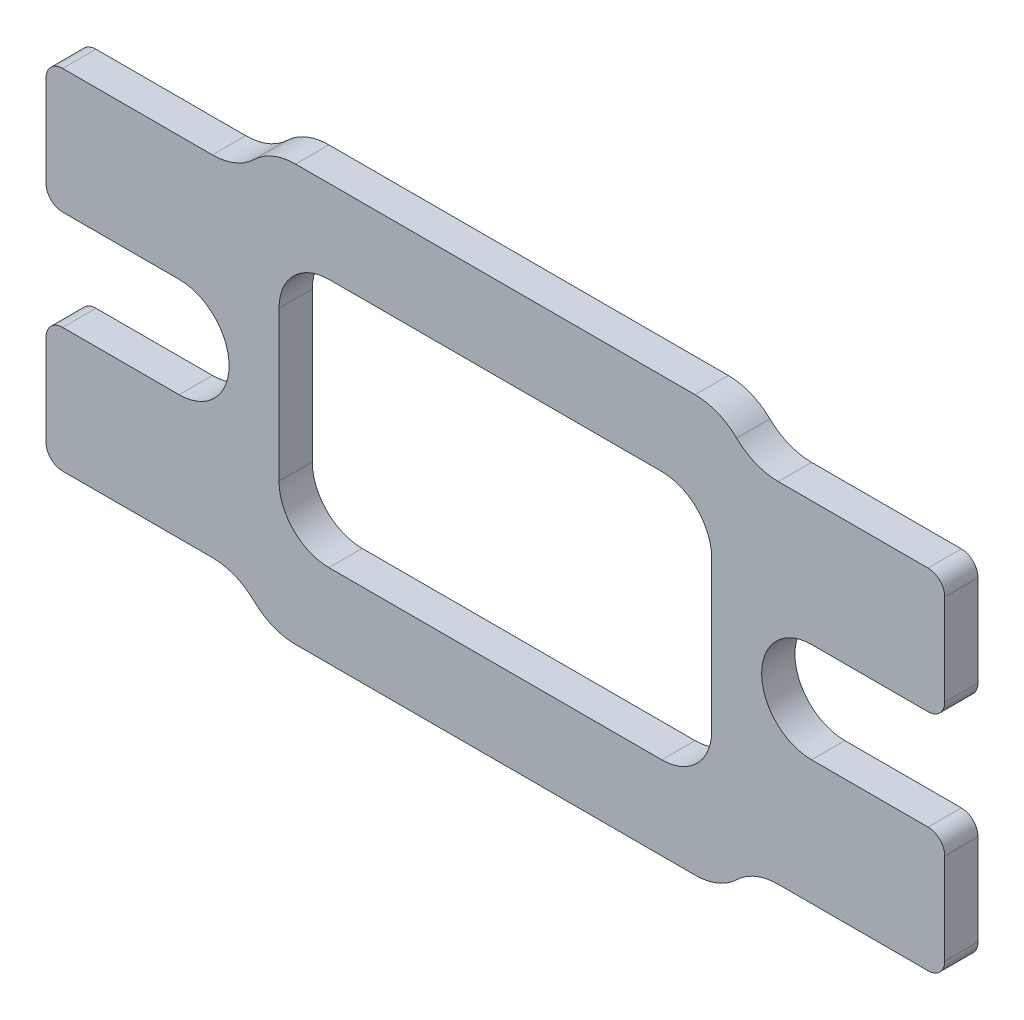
from build123d import *

# Parameters (mm, degrees)
BOSS_EXTRU_1_DEPTH = 2


with BuildPart() as part:
    # Esquisse1 → Boss.-Extru.1 (new body)
    with BuildSketch(Plane.XY):
        with BuildLine():
            Line((17, -74.978393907), (26, -74.978393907))
            ThreePointArc((26, -74.978393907), (26.707106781, -74.685500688), (27, -73.978393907))
            Line((27, -73.978393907), (27, -68.5))
            ThreePointArc((27, -68.5), (26.707106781, -67.792893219), (26, -67.5))
            Line((26, -67.5), (19, -67.5))
            ThreePointArc((19, -67.5), (16, -64.5), (19, -61.5))
            Line((19, -61.5), (26, -61.5))
            ThreePointArc((26, -61.5), (26.707106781, -61.207106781), (27, -60.5))
            Line((27, -60.5), (27, -55.021606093))
            ThreePointArc((27, -55.021606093), (26.707106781, -54.314499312), (26, -54.021606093))
            Line((26, -54.021606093), (17, -54.021606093))
            ThreePointArc((17, -54.021606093), (15.651693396, -53.75934443), (14.5, -53.010803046))
            ThreePointArc((14.5, -53.010803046), (13.348306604, -52.262261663), (12, -52))
            Line((12, -52), (-12, -52))
            ThreePointArc((-12, -52), (-13.348306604, -52.262261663), (-14.5, -53.010803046))
            ThreePointArc((-14.5, -53.010803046), (-15.651693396, -53.75934443), (-17, -54.021606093))
            Line((-17, -54.021606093), (-26, -54.021606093))
            ThreePointArc((-26, -54.021606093), (-26.707106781, -54.314499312), (-27, -55.021606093))
            Line((-27, -55.021606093), (-27, -60.5))
            ThreePointArc((-27, -60.5), (-26.707106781, -61.207106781), (-26, -61.5))
            Line((-26, -61.5), (-19, -61.5))
            ThreePointArc((-19, -61.5), (-16, -64.5), (-19, -67.5))
            Line((-19, -67.5), (-26, -67.5))
            ThreePointArc((-26, -67.5), (-26.707106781, -67.792893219), (-27, -68.5))
            Line((-27, -68.5), (-27, -73.978393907))
            ThreePointArc((-27, -73.978393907), (-26.707106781, -74.685500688), (-26, -74.978393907))
            Line((-26, -74.978393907), (-17, -74.978393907))
            ThreePointArc((-17, -74.978393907), (-15.651693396, -75.24065557), (-14.5, -75.989196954))
            ThreePointArc((-14.5, -75.989196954), (-13.348306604, -76.737738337), (-12, -77))
            Line((-12, -77), (12, -77))
            ThreePointArc((12, -77), (13.348306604, -76.737738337), (14.5, -75.989196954))
            ThreePointArc((14.5, -75.989196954), (15.651693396, -75.24065557), (17, -74.978393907))
        make_face()
        with BuildLine():
            Line((10, -57), (-10, -57))
            ThreePointArc((-10, -57), (-12.121320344, -57.878679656), (-13, -60))
            Line((-13, -60), (-13, -69))
            ThreePointArc((-13, -69), (-12.121320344, -71.121320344), (-10, -72))
            Line((-10, -72), (10, -72))
            ThreePointArc((10, -72), (12.121320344, -71.121320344), (13, -69))
            Line((13, -69), (13, -60))
            ThreePointArc((13, -60), (12.121320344, -57.878679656), (10, -57))
        make_face(mode=Mode.SUBTRACT)
    extrude(amount=BOSS_EXTRU_1_DEPTH)


solid = part.part
